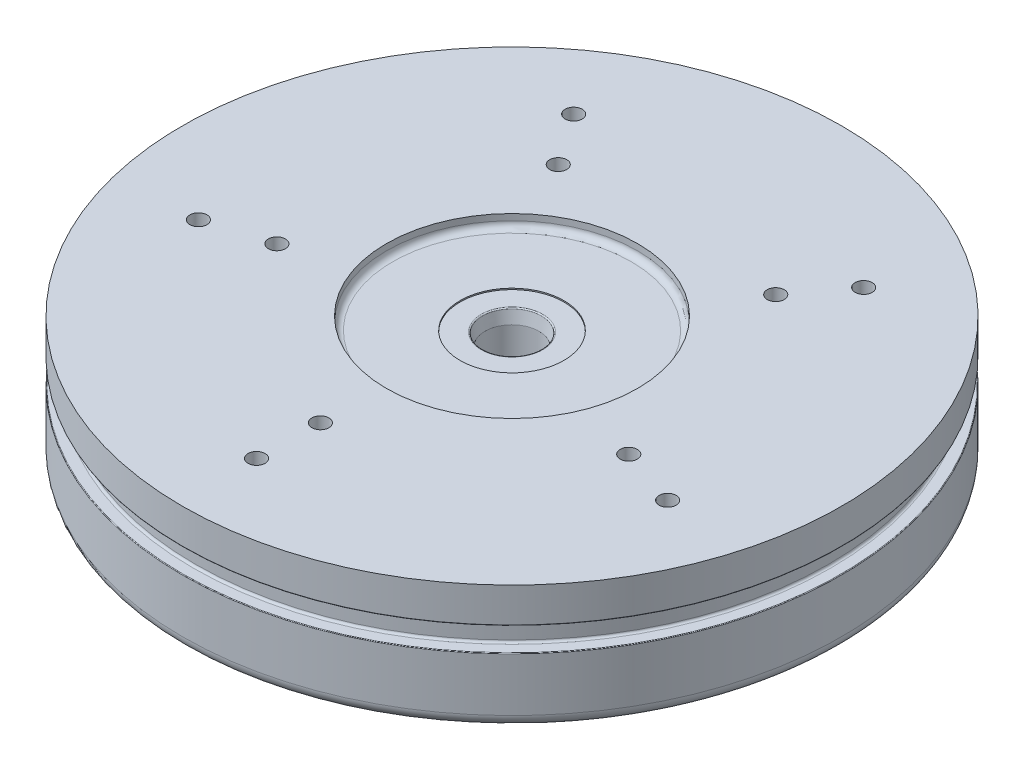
from build123d import *

# Parameters (mm, degrees)
FILLET1_R                      = 2.54
F_8_32_TAPPED_HOLE1_AT_2_COUNT = 2
F_8_32_TAPPED_HOLE1_AT_2_PITCH = 12.7
CIRPATTERN1_COUNT              = 5
SKETCH5_R                      = 25.4
CUT_EXTRUDE1_DEPTH             = 2.54
FILLET2_R                      = 1.27


with BuildPart() as part:
    # Sketch1 → Revolve1 (revolve)
    with BuildSketch(Plane.XY, mode=Mode.PRIVATE) as revolve1_sk:
        with BuildLine():
            Line((-64.4779, 13.462), (-66.548, 13.462))
            ThreePointArc((-66.548, 13.462), (-66.637802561, 13.424802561), (-66.675, 13.335))
            Line((-66.675, 13.335), (-66.675, 0))
            Line((-66.675, 0), (-53.975, 0))
            Line((-53.975, 0), (0, 12.7))
            Line((0, 12.7), (0, 25.4))
            Line((0, 25.4), (-66.675, 25.4))
            Line((-66.675, 25.4), (-66.675, 18.415))
            ThreePointArc((-66.675, 18.415), (-66.637802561, 18.325197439), (-66.548, 18.288))
            Line((-66.548, 18.288), (-64.4779, 18.288))
            ThreePointArc((-64.4779, 18.288), (-64.163591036, 18.157808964), (-64.0334, 17.8435))
            Line((-64.0334, 17.8435), (-64.0334, 13.9065))
            ThreePointArc((-64.0334, 13.9065), (-64.163591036, 13.592191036), (-64.4779, 13.462))
        make_face()
    revolve(revolve1_sk.sketch.rotate(Axis((0, 12.7, 0), (0, 1, 0)), 270), axis=Axis((0, 12.7, 0), (0, 1, 0)))

    # Fillet1
    fillet1_edges = [part.edges().sort_by_distance(p)[0] for p in [
        (0, 0, 66.675),
    ]]
    fillet(fillet1_edges, radius=FILLET1_R)

    # Sketch3 → 8-32 Tapped Hole1 (revolve, cut)
    with BuildSketch(Plane(origin=(36.02425773, 25.4, 12.404146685), x_dir=(0, 0, 1), z_dir=(1, 0, 0))):
        Polygon((0, 0), (0, 9.775406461), (1.7272, 8.7376), (1.7272, 0), align=None)
    f_8_32_tapped_hole1 = revolve(axis=Axis((36.02425773, 31.75, 12.404146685), (0, -1, 0)), mode=Mode.SUBTRACT)

    # 8-32 Tapped Hole1 at 2: 8-32 Tapped Hole1 ×2
    with Locations(*[Vector(0.9455185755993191, 0, 0.32556815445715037) * (i * F_8_32_TAPPED_HOLE1_AT_2_PITCH) for i in range(1, F_8_32_TAPPED_HOLE1_AT_2_COUNT)]):
        add(f_8_32_tapped_hole1, mode=Mode.SUBTRACT)

    # CirPattern1: 8-32 Tapped Hole1 ×5 about axis
    cirpattern1_axis = Axis((0, 0, 0), (0, 1, 0))
    for i in range(1, CIRPATTERN1_COUNT):
        add(f_8_32_tapped_hole1.rotate(cirpattern1_axis, i * 360 / CIRPATTERN1_COUNT), mode=Mode.SUBTRACT)

    # CirPattern1 copy 1 sketch → CirPattern1 copy 1 (revolve, cut)
    with BuildSketch(Plane(origin=(30.572203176, 25.4, -40.57068391), x_dir=(0.9510565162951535, 0, 0.30901699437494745), z_dir=(0.30901699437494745, 0, -0.9510565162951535))):
        Polygon((0, 0), (0, 9.775406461), (1.7272, 8.7376), (1.7272, 0), align=None)
    revolve(axis=Axis((30.572203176, 31.75, -40.57068391), (0, -1, 0)), mode=Mode.SUBTRACT)

    # CirPattern1 copy 2 sketch → CirPattern1 copy 2 (revolve, cut)
    with BuildSketch(Plane(origin=(-29.137682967, 25.4, -41.61292385), x_dir=(0.5877852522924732, 0, -0.8090169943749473), z_dir=(-0.8090169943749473, 0, -0.5877852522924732))):
        Polygon((0, 0), (0, 9.775406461), (1.7272, 8.7376), (1.7272, 0), align=None)
    revolve(axis=Axis((-29.137682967, 31.75, -41.61292385), (0, -1, 0)), mode=Mode.SUBTRACT)

    # CirPattern1 copy 3 sketch → CirPattern1 copy 3 (revolve, cut)
    with BuildSketch(Plane(origin=(-48.580281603, 25.4, 14.8524826), x_dir=(-0.587785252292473, 0, -0.8090169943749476), z_dir=(-0.8090169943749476, 0, 0.587785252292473))):
        Polygon((0, 0), (0, 9.775406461), (1.7272, 8.7376), (1.7272, 0), align=None)
    revolve(axis=Axis((-48.580281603, 31.75, 14.8524826), (0, -1, 0)), mode=Mode.SUBTRACT)

    # CirPattern1 copy 4 sketch → CirPattern1 copy 4 (revolve, cut)
    with BuildSketch(Plane(origin=(-0.886582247, 25.4, 50.792262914), x_dir=(-0.9510565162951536, 0, 0.30901699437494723), z_dir=(0.30901699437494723, 0, 0.9510565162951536))):
        Polygon((0, 0), (0, 9.775406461), (1.7272, 8.7376), (1.7272, 0), align=None)
    revolve(axis=Axis((-0.886582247, 31.75, 50.792262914), (0, -1, 0)), mode=Mode.SUBTRACT)

    # Sketch5 → Cut-Extrude1 (cut)
    with BuildSketch(Plane(origin=(0, 25.4, 0), x_dir=(1, 0, 0), z_dir=(0, 1, 0))):
        with Locations(Location((0, 0, 0), (0, 0, 270))):
            Circle(SKETCH5_R)
    extrude(amount=-CUT_EXTRUDE1_DEPTH, mode=Mode.SUBTRACT)

    # Fillet2
    fillet2_edges = [part.edges().sort_by_distance(p)[0] for p in [
        (0, 22.86, -25.4),
    ]]
    fillet(fillet2_edges, radius=FILLET2_R)

    # Port Sketch → SAE Port (revolve, cut)
    with BuildSketch(Plane(origin=(-1.235273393, 22.86, -1.453558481), x_dir=(0.6475719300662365, 0, 0.7620043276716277), z_dir=(0.7620043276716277, 0, -0.6475719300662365)), mode=Mode.PRIVATE) as sae_port_sk:
        with BuildLine():
            Line((1.907546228, 28.634641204), (6.868166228, 25.654))
            Line((6.868166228, 25.654), (6.868166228, 11.754))
            Line((6.868166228, 11.754), (7.463796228, 11.754))
            Line((7.463796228, 11.754), (7.463796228, 2.764417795))
            Line((7.463796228, 2.764417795), (7.374214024, 2.854))
            Line((7.374214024, 2.854), (7.884096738, 0.455190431))
            ThreePointArc((7.884096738, 0.455190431), (7.972698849, 0.310604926), (8.132546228, 0.254))
            Line((8.132546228, 0.254), (12.407546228, 0.254))
            Line((12.407546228, 0.254), (12.407546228, 0))
            Line((12.407546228, 0), (1.907546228, 0))
            Line((1.907546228, 0), (1.907546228, 28.634641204))
        make_face()
    revolve(sae_port_sk.sketch.rotate(Axis((0, 22.86, 0), (0, -1, 0)), 40.358784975), axis=Axis((0, 22.86, 0), (0, -1, 0)), mode=Mode.SUBTRACT)


solid = part.part
